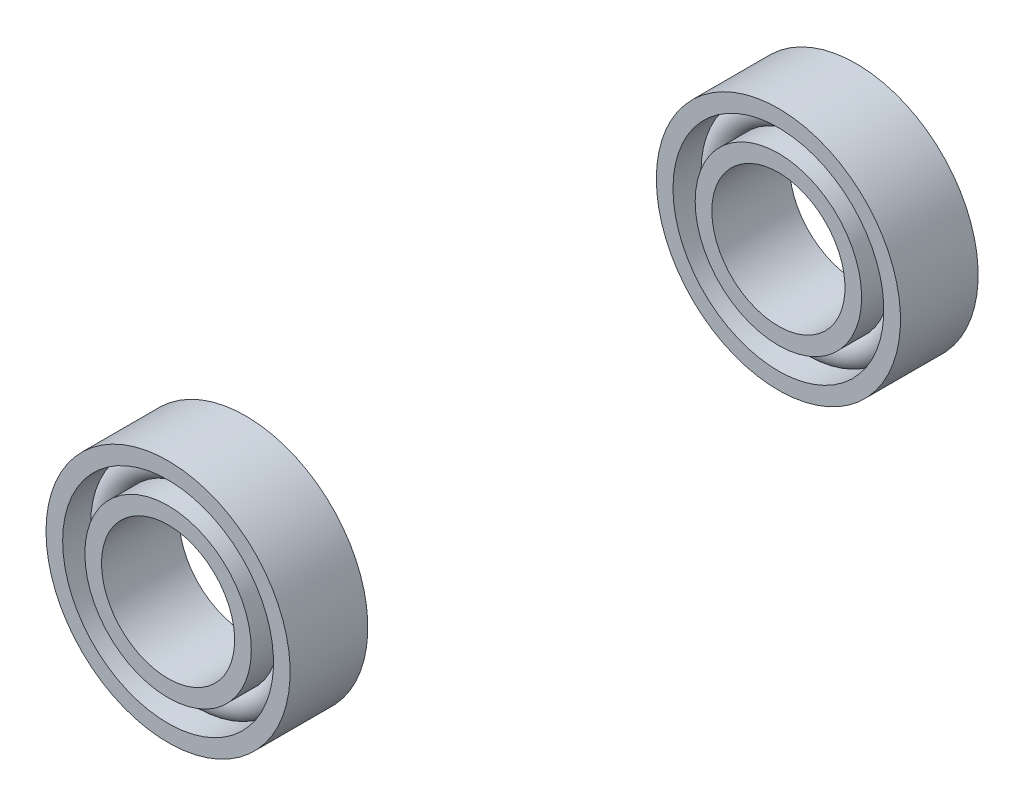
ISO-10303-21;
HEADER;
FILE_DESCRIPTION(('STEP AP214'),'2;1');
FILE_NAME('part.step','',(''),(''),'','','');
FILE_SCHEMA(('AUTOMOTIVE_DESIGN { 1 0 10303 214 1 1 1 1 }'));
ENDSEC;
DATA;
#1=APPLICATION_CONTEXT('core data for automotive mechanical design processes');
#2=APPLICATION_PROTOCOL_DEFINITION('international standard','automotive_design',2000,#1);
#3=PRODUCT_CONTEXT('',#1,'mechanical');
#4=PRODUCT('Part','Part','',(#3));
#5=PRODUCT_RELATED_PRODUCT_CATEGORY('part','',(#4));
#6=PRODUCT_DEFINITION_FORMATION('','',#4);
#7=PRODUCT_DEFINITION_CONTEXT('part definition',#1,'design');
#8=PRODUCT_DEFINITION('design','',#6,#7);
#9=PRODUCT_DEFINITION_SHAPE('','',#8);
#10=(LENGTH_UNIT() NAMED_UNIT(*) SI_UNIT(.MILLI.,.METRE.));
#11=(NAMED_UNIT(*) PLANE_ANGLE_UNIT() SI_UNIT($,.RADIAN.));
#12=(NAMED_UNIT(*) SI_UNIT($,.STERADIAN.) SOLID_ANGLE_UNIT());
#13=UNCERTAINTY_MEASURE_WITH_UNIT(LENGTH_MEASURE(1.E-05),#10,'distance_accuracy_value','');
#14=(GEOMETRIC_REPRESENTATION_CONTEXT(3) GLOBAL_UNCERTAINTY_ASSIGNED_CONTEXT((#13)) GLOBAL_UNIT_ASSIGNED_CONTEXT((#10,
#11,#12)) REPRESENTATION_CONTEXT('',''));
#15=CARTESIAN_POINT('',(0.,0.,0.));
#16=DIRECTION('',(0.,0.,1.));
#17=DIRECTION('',(1.,0.,0.));
#18=AXIS2_PLACEMENT_3D('',#15,#16,#17);
#19=CARTESIAN_POINT('',(172.5,0.,143.));
#20=DIRECTION('',(0.,0.,-1.));
#21=DIRECTION('',(-1.,0.,0.));
#22=AXIS2_PLACEMENT_3D('',#19,#20,#21);
#23=TOROIDAL_SURFACE('',#22,8.50000000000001,1.40000000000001);
#24=CARTESIAN_POINT('',(172.5,0.,142.020204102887));
#25=DIRECTION('',(0.,0.,1.));
#26=DIRECTION('',(1.,0.,0.));
#27=AXIS2_PLACEMENT_3D('',#24,#25,#26);
#28=CIRCLE('',#27,7.50000000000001);
#29=CARTESIAN_POINT('',(180.,0.,142.020204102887));
#30=VERTEX_POINT('',#29);
#31=EDGE_CURVE('E53',#30,#30,#28,.T.);
#32=ORIENTED_EDGE('',*,*,#31,.T.);
#33=EDGE_LOOP('',(#32));
#34=FACE_BOUND('',#33,.T.);
#35=CARTESIAN_POINT('',(172.5,0.,142.020204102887));
#36=DIRECTION('',(0.,0.,1.));
#37=DIRECTION('',(1.,0.,0.));
#38=AXIS2_PLACEMENT_3D('',#35,#36,#37);
#39=CIRCLE('',#38,9.50000000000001);
#40=CARTESIAN_POINT('',(182.,0.,142.020204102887));
#41=VERTEX_POINT('',#40);
#42=EDGE_CURVE('E11',#41,#41,#39,.T.);
#43=ORIENTED_EDGE('',*,*,#42,.F.);
#44=EDGE_LOOP('',(#43));
#45=FACE_BOUND('',#44,.T.);
#46=ADVANCED_FACE('F42',(#34,#45),#23,.T.);
#47=CARTESIAN_POINT('',(172.5,0.,143.979795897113));
#48=DIRECTION('',(0.,0.,-1.));
#49=DIRECTION('',(-1.,0.,0.));
#50=AXIS2_PLACEMENT_3D('',#47,#48,#49);
#51=CIRCLE('',#50,7.50000000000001);
#52=CARTESIAN_POINT('',(165.,0.,143.979795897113));
#53=VERTEX_POINT('',#52);
#54=EDGE_CURVE('E57',#53,#53,#51,.T.);
#55=ORIENTED_EDGE('',*,*,#54,.T.);
#56=EDGE_LOOP('',(#55));
#57=FACE_BOUND('',#56,.T.);
#58=CARTESIAN_POINT('',(172.5,0.,143.979795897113));
#59=DIRECTION('',(0.,0.,-1.));
#60=DIRECTION('',(-1.,0.,0.));
#61=AXIS2_PLACEMENT_3D('',#58,#59,#60);
#62=CIRCLE('',#61,9.50000000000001);
#63=CARTESIAN_POINT('',(163.,0.,143.979795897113));
#64=VERTEX_POINT('',#63);
#65=EDGE_CURVE('E49',#64,#64,#62,.T.);
#66=ORIENTED_EDGE('',*,*,#65,.F.);
#67=EDGE_LOOP('',(#66));
#68=FACE_BOUND('',#67,.T.);
#69=ADVANCED_FACE('F105',(#57,#68),#23,.T.);
#70=CARTESIAN_POINT('',(172.5,0.,134.5));
#71=DIRECTION('',(0.,0.,-1.));
#72=DIRECTION('',(-1.,0.,0.));
#73=AXIS2_PLACEMENT_3D('',#70,#71,#72);
#74=CYLINDRICAL_SURFACE('',#73,7.50000000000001);
#75=CARTESIAN_POINT('',(172.5,0.,139.5));
#76=DIRECTION('',(0.,0.,-1.));
#77=DIRECTION('',(-1.,0.,0.));
#78=AXIS2_PLACEMENT_3D('',#75,#76,#77);
#79=CIRCLE('',#78,7.50000000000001);
#80=CARTESIAN_POINT('',(165.,0.,139.5));
#81=VERTEX_POINT('',#80);
#82=EDGE_CURVE('E65',#81,#81,#79,.T.);
#83=ORIENTED_EDGE('',*,*,#82,.F.);
#84=EDGE_LOOP('',(#83));
#85=FACE_BOUND('',#84,.T.);
#86=ORIENTED_EDGE('',*,*,#31,.F.);
#87=EDGE_LOOP('',(#86));
#88=FACE_BOUND('',#87,.T.);
#89=ADVANCED_FACE('F110',(#85,#88),#74,.T.);
#90=CARTESIAN_POINT('',(172.5,0.,146.5));
#91=DIRECTION('',(0.,0.,-1.));
#92=DIRECTION('',(-1.,0.,0.));
#93=AXIS2_PLACEMENT_3D('',#90,#91,#92);
#94=CIRCLE('',#93,7.50000000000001);
#95=CARTESIAN_POINT('',(165.,0.,146.5));
#96=VERTEX_POINT('',#95);
#97=EDGE_CURVE('E68',#96,#96,#94,.T.);
#98=ORIENTED_EDGE('',*,*,#97,.T.);
#99=EDGE_LOOP('',(#98));
#100=FACE_BOUND('',#99,.T.);
#101=ORIENTED_EDGE('',*,*,#54,.F.);
#102=EDGE_LOOP('',(#101));
#103=FACE_BOUND('',#102,.T.);
#104=ADVANCED_FACE('F119',(#100,#103),#74,.T.);
#105=CARTESIAN_POINT('',(172.5,0.,134.5));
#106=DIRECTION('',(0.,0.,-1.));
#107=DIRECTION('',(-1.,0.,0.));
#108=AXIS2_PLACEMENT_3D('',#105,#106,#107);
#109=CYLINDRICAL_SURFACE('',#108,6.00000000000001);
#110=CARTESIAN_POINT('',(172.5,0.,146.5));
#111=DIRECTION('',(0.,0.,-1.));
#112=DIRECTION('',(-1.,0.,0.));
#113=AXIS2_PLACEMENT_3D('',#110,#111,#112);
#114=CIRCLE('',#113,6.00000000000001);
#115=CARTESIAN_POINT('',(166.5,0.,146.5));
#116=VERTEX_POINT('',#115);
#117=EDGE_CURVE('E71',#116,#116,#114,.T.);
#118=ORIENTED_EDGE('',*,*,#117,.F.);
#119=EDGE_LOOP('',(#118));
#120=FACE_BOUND('',#119,.T.);
#121=CARTESIAN_POINT('',(172.5,0.,139.5));
#122=DIRECTION('',(0.,0.,-1.));
#123=DIRECTION('',(-1.,0.,0.));
#124=AXIS2_PLACEMENT_3D('',#121,#122,#123);
#125=CIRCLE('',#124,6.00000000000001);
#126=CARTESIAN_POINT('',(166.5,0.,139.5));
#127=VERTEX_POINT('',#126);
#128=EDGE_CURVE('E62',#127,#127,#125,.T.);
#129=ORIENTED_EDGE('',*,*,#128,.T.);
#130=EDGE_LOOP('',(#129));
#131=FACE_BOUND('',#130,.T.);
#132=ADVANCED_FACE('F44',(#120,#131),#109,.F.);
#133=CARTESIAN_POINT('',(178.5,0.,139.5));
#134=DIRECTION('',(0.,0.,1.));
#135=DIRECTION('',(1.,0.,0.));
#136=AXIS2_PLACEMENT_3D('',#133,#134,#135);
#137=PLANE('',#136);
#138=ORIENTED_EDGE('',*,*,#128,.F.);
#139=EDGE_LOOP('',(#138));
#140=FACE_BOUND('',#139,.T.);
#141=ORIENTED_EDGE('',*,*,#82,.T.);
#142=EDGE_LOOP('',(#141));
#143=FACE_BOUND('',#142,.T.);
#144=ADVANCED_FACE('F116',(#140,#143),#137,.F.);
#145=CARTESIAN_POINT('',(180.,0.,146.5));
#146=DIRECTION('',(0.,0.,-1.));
#147=DIRECTION('',(-1.,0.,0.));
#148=AXIS2_PLACEMENT_3D('',#145,#146,#147);
#149=PLANE('',#148);
#150=ORIENTED_EDGE('',*,*,#97,.F.);
#151=EDGE_LOOP('',(#150));
#152=FACE_BOUND('',#151,.T.);
#153=ORIENTED_EDGE('',*,*,#117,.T.);
#154=EDGE_LOOP('',(#153));
#155=FACE_BOUND('',#154,.T.);
#156=ADVANCED_FACE('F101',(#152,#155),#149,.F.);
#157=CARTESIAN_POINT('',(172.5,0.,134.5));
#158=DIRECTION('',(0.,0.,-1.));
#159=DIRECTION('',(-1.,0.,0.));
#160=AXIS2_PLACEMENT_3D('',#157,#158,#159);
#161=CYLINDRICAL_SURFACE('',#160,9.50000000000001);
#162=CARTESIAN_POINT('',(172.5,0.,139.5));
#163=DIRECTION('',(0.,0.,-1.));
#164=DIRECTION('',(-1.,0.,0.));
#165=AXIS2_PLACEMENT_3D('',#162,#163,#164);
#166=CIRCLE('',#165,9.50000000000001);
#167=CARTESIAN_POINT('',(163.,0.,139.5));
#168=VERTEX_POINT('',#167);
#169=EDGE_CURVE('E74',#168,#168,#166,.T.);
#170=ORIENTED_EDGE('',*,*,#169,.T.);
#171=EDGE_LOOP('',(#170));
#172=FACE_BOUND('',#171,.T.);
#173=ORIENTED_EDGE('',*,*,#42,.T.);
#174=EDGE_LOOP('',(#173));
#175=FACE_BOUND('',#174,.T.);
#176=ADVANCED_FACE('F92',(#172,#175),#161,.F.);
#177=CARTESIAN_POINT('',(172.5,0.,146.5));
#178=DIRECTION('',(0.,0.,-1.));
#179=DIRECTION('',(-1.,0.,0.));
#180=AXIS2_PLACEMENT_3D('',#177,#178,#179);
#181=CIRCLE('',#180,9.50000000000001);
#182=CARTESIAN_POINT('',(163.,0.,146.5));
#183=VERTEX_POINT('',#182);
#184=EDGE_CURVE('E83',#183,#183,#181,.T.);
#185=ORIENTED_EDGE('',*,*,#184,.F.);
#186=EDGE_LOOP('',(#185));
#187=FACE_BOUND('',#186,.T.);
#188=ORIENTED_EDGE('',*,*,#65,.T.);
#189=EDGE_LOOP('',(#188));
#190=FACE_BOUND('',#189,.T.);
#191=ADVANCED_FACE('F89',(#187,#190),#161,.F.);
#192=CARTESIAN_POINT('',(182.,0.,139.5));
#193=DIRECTION('',(0.,0.,1.));
#194=DIRECTION('',(1.,0.,0.));
#195=AXIS2_PLACEMENT_3D('',#192,#193,#194);
#196=PLANE('',#195);
#197=ORIENTED_EDGE('',*,*,#169,.F.);
#198=EDGE_LOOP('',(#197));
#199=FACE_BOUND('',#198,.T.);
#200=CARTESIAN_POINT('',(172.5,0.,139.5));
#201=DIRECTION('',(0.,0.,-1.));
#202=DIRECTION('',(-1.,0.,0.));
#203=AXIS2_PLACEMENT_3D('',#200,#201,#202);
#204=CIRCLE('',#203,11.);
#205=CARTESIAN_POINT('',(161.5,0.,139.5));
#206=VERTEX_POINT('',#205);
#207=EDGE_CURVE('E77',#206,#206,#204,.T.);
#208=ORIENTED_EDGE('',*,*,#207,.T.);
#209=EDGE_LOOP('',(#208));
#210=FACE_BOUND('',#209,.T.);
#211=ADVANCED_FACE('F91',(#199,#210),#196,.F.);
#212=CARTESIAN_POINT('',(172.5,0.,134.5));
#213=DIRECTION('',(0.,0.,-1.));
#214=DIRECTION('',(-1.,0.,0.));
#215=AXIS2_PLACEMENT_3D('',#212,#213,#214);
#216=CYLINDRICAL_SURFACE('',#215,11.);
#217=ORIENTED_EDGE('',*,*,#207,.F.);
#218=EDGE_LOOP('',(#217));
#219=FACE_BOUND('',#218,.T.);
#220=CARTESIAN_POINT('',(172.5,0.,146.5));
#221=DIRECTION('',(0.,0.,-1.));
#222=DIRECTION('',(-1.,0.,0.));
#223=AXIS2_PLACEMENT_3D('',#220,#221,#222);
#224=CIRCLE('',#223,11.);
#225=CARTESIAN_POINT('',(161.5,0.,146.5));
#226=VERTEX_POINT('',#225);
#227=EDGE_CURVE('E80',#226,#226,#224,.T.);
#228=ORIENTED_EDGE('',*,*,#227,.T.);
#229=EDGE_LOOP('',(#228));
#230=FACE_BOUND('',#229,.T.);
#231=ADVANCED_FACE('F98',(#219,#230),#216,.T.);
#232=CARTESIAN_POINT('',(183.5,0.,146.5));
#233=DIRECTION('',(0.,0.,-1.));
#234=DIRECTION('',(-1.,0.,0.));
#235=AXIS2_PLACEMENT_3D('',#232,#233,#234);
#236=PLANE('',#235);
#237=ORIENTED_EDGE('',*,*,#227,.F.);
#238=EDGE_LOOP('',(#237));
#239=FACE_BOUND('',#238,.T.);
#240=ORIENTED_EDGE('',*,*,#184,.T.);
#241=EDGE_LOOP('',(#240));
#242=FACE_BOUND('',#241,.T.);
#243=ADVANCED_FACE('F87',(#239,#242),#236,.F.);
#244=CLOSED_SHELL('',(#46,#69,#89,#104,#132,#144,#156,#176,#191,#211,#231,#243));
#245=MANIFOLD_SOLID_BREP('B2',#244);
#246=CARTESIAN_POINT('',(172.5,0.,88.));
#247=DIRECTION('',(0.,0.,-1.));
#248=DIRECTION('',(-1.,0.,0.));
#249=AXIS2_PLACEMENT_3D('',#246,#247,#248);
#250=TOROIDAL_SURFACE('',#249,8.50000000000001,1.40000000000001);
#251=CARTESIAN_POINT('',(172.5,0.,87.0202041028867));
#252=DIRECTION('',(0.,0.,1.));
#253=DIRECTION('',(1.,0.,0.));
#254=AXIS2_PLACEMENT_3D('',#251,#252,#253);
#255=CIRCLE('',#254,7.50000000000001);
#256=CARTESIAN_POINT('',(180.,0.,87.0202041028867));
#257=VERTEX_POINT('',#256);
#258=EDGE_CURVE('E231',#257,#257,#255,.T.);
#259=ORIENTED_EDGE('',*,*,#258,.T.);
#260=EDGE_LOOP('',(#259));
#261=FACE_BOUND('',#260,.T.);
#262=CARTESIAN_POINT('',(172.5,0.,87.0202041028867));
#263=DIRECTION('',(0.,0.,1.));
#264=DIRECTION('',(1.,0.,0.));
#265=AXIS2_PLACEMENT_3D('',#262,#263,#264);
#266=CIRCLE('',#265,9.50000000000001);
#267=CARTESIAN_POINT('',(182.,0.,87.0202041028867));
#268=VERTEX_POINT('',#267);
#269=EDGE_CURVE('E41',#268,#268,#266,.T.);
#270=ORIENTED_EDGE('',*,*,#269,.F.);
#271=EDGE_LOOP('',(#270));
#272=FACE_BOUND('',#271,.T.);
#273=ADVANCED_FACE('F220',(#261,#272),#250,.T.);
#274=CARTESIAN_POINT('',(172.5,0.,88.9797958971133));
#275=DIRECTION('',(0.,0.,-1.));
#276=DIRECTION('',(-1.,0.,0.));
#277=AXIS2_PLACEMENT_3D('',#274,#275,#276);
#278=CIRCLE('',#277,7.50000000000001);
#279=CARTESIAN_POINT('',(165.,0.,88.9797958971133));
#280=VERTEX_POINT('',#279);
#281=EDGE_CURVE('E235',#280,#280,#278,.T.);
#282=ORIENTED_EDGE('',*,*,#281,.T.);
#283=EDGE_LOOP('',(#282));
#284=FACE_BOUND('',#283,.T.);
#285=CARTESIAN_POINT('',(172.5,0.,88.9797958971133));
#286=DIRECTION('',(0.,0.,-1.));
#287=DIRECTION('',(-1.,0.,0.));
#288=AXIS2_PLACEMENT_3D('',#285,#286,#287);
#289=CIRCLE('',#288,9.50000000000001);
#290=CARTESIAN_POINT('',(163.,0.,88.9797958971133));
#291=VERTEX_POINT('',#290);
#292=EDGE_CURVE('E227',#291,#291,#289,.T.);
#293=ORIENTED_EDGE('',*,*,#292,.F.);
#294=EDGE_LOOP('',(#293));
#295=FACE_BOUND('',#294,.T.);
#296=ADVANCED_FACE('F283',(#284,#295),#250,.T.);
#297=CARTESIAN_POINT('',(172.5,0.,79.5));
#298=DIRECTION('',(0.,0.,-1.));
#299=DIRECTION('',(-1.,0.,0.));
#300=AXIS2_PLACEMENT_3D('',#297,#298,#299);
#301=CYLINDRICAL_SURFACE('',#300,7.50000000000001);
#302=CARTESIAN_POINT('',(172.5,0.,84.5));
#303=DIRECTION('',(0.,0.,-1.));
#304=DIRECTION('',(-1.,0.,0.));
#305=AXIS2_PLACEMENT_3D('',#302,#303,#304);
#306=CIRCLE('',#305,7.50000000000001);
#307=CARTESIAN_POINT('',(165.,0.,84.5));
#308=VERTEX_POINT('',#307);
#309=EDGE_CURVE('E243',#308,#308,#306,.T.);
#310=ORIENTED_EDGE('',*,*,#309,.F.);
#311=EDGE_LOOP('',(#310));
#312=FACE_BOUND('',#311,.T.);
#313=ORIENTED_EDGE('',*,*,#258,.F.);
#314=EDGE_LOOP('',(#313));
#315=FACE_BOUND('',#314,.T.);
#316=ADVANCED_FACE('F288',(#312,#315),#301,.T.);
#317=CARTESIAN_POINT('',(172.5,0.,91.5));
#318=DIRECTION('',(0.,0.,-1.));
#319=DIRECTION('',(-1.,0.,0.));
#320=AXIS2_PLACEMENT_3D('',#317,#318,#319);
#321=CIRCLE('',#320,7.50000000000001);
#322=CARTESIAN_POINT('',(165.,0.,91.5));
#323=VERTEX_POINT('',#322);
#324=EDGE_CURVE('E246',#323,#323,#321,.T.);
#325=ORIENTED_EDGE('',*,*,#324,.T.);
#326=EDGE_LOOP('',(#325));
#327=FACE_BOUND('',#326,.T.);
#328=ORIENTED_EDGE('',*,*,#281,.F.);
#329=EDGE_LOOP('',(#328));
#330=FACE_BOUND('',#329,.T.);
#331=ADVANCED_FACE('F297',(#327,#330),#301,.T.);
#332=CARTESIAN_POINT('',(172.5,0.,79.5));
#333=DIRECTION('',(0.,0.,-1.));
#334=DIRECTION('',(-1.,0.,0.));
#335=AXIS2_PLACEMENT_3D('',#332,#333,#334);
#336=CYLINDRICAL_SURFACE('',#335,6.00000000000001);
#337=CARTESIAN_POINT('',(172.5,0.,91.5));
#338=DIRECTION('',(0.,0.,-1.));
#339=DIRECTION('',(-1.,0.,0.));
#340=AXIS2_PLACEMENT_3D('',#337,#338,#339);
#341=CIRCLE('',#340,6.00000000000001);
#342=CARTESIAN_POINT('',(166.5,0.,91.5));
#343=VERTEX_POINT('',#342);
#344=EDGE_CURVE('E249',#343,#343,#341,.T.);
#345=ORIENTED_EDGE('',*,*,#344,.F.);
#346=EDGE_LOOP('',(#345));
#347=FACE_BOUND('',#346,.T.);
#348=CARTESIAN_POINT('',(172.5,0.,84.5));
#349=DIRECTION('',(0.,0.,-1.));
#350=DIRECTION('',(-1.,0.,0.));
#351=AXIS2_PLACEMENT_3D('',#348,#349,#350);
#352=CIRCLE('',#351,6.00000000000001);
#353=CARTESIAN_POINT('',(166.5,0.,84.5));
#354=VERTEX_POINT('',#353);
#355=EDGE_CURVE('E240',#354,#354,#352,.T.);
#356=ORIENTED_EDGE('',*,*,#355,.T.);
#357=EDGE_LOOP('',(#356));
#358=FACE_BOUND('',#357,.T.);
#359=ADVANCED_FACE('F222',(#347,#358),#336,.F.);
#360=CARTESIAN_POINT('',(178.5,0.,84.5));
#361=DIRECTION('',(0.,0.,1.));
#362=DIRECTION('',(1.,0.,0.));
#363=AXIS2_PLACEMENT_3D('',#360,#361,#362);
#364=PLANE('',#363);
#365=ORIENTED_EDGE('',*,*,#355,.F.);
#366=EDGE_LOOP('',(#365));
#367=FACE_BOUND('',#366,.T.);
#368=ORIENTED_EDGE('',*,*,#309,.T.);
#369=EDGE_LOOP('',(#368));
#370=FACE_BOUND('',#369,.T.);
#371=ADVANCED_FACE('F294',(#367,#370),#364,.F.);
#372=CARTESIAN_POINT('',(180.,0.,91.5));
#373=DIRECTION('',(0.,0.,-1.));
#374=DIRECTION('',(-1.,0.,0.));
#375=AXIS2_PLACEMENT_3D('',#372,#373,#374);
#376=PLANE('',#375);
#377=ORIENTED_EDGE('',*,*,#324,.F.);
#378=EDGE_LOOP('',(#377));
#379=FACE_BOUND('',#378,.T.);
#380=ORIENTED_EDGE('',*,*,#344,.T.);
#381=EDGE_LOOP('',(#380));
#382=FACE_BOUND('',#381,.T.);
#383=ADVANCED_FACE('F279',(#379,#382),#376,.F.);
#384=CARTESIAN_POINT('',(172.5,0.,79.5));
#385=DIRECTION('',(0.,0.,-1.));
#386=DIRECTION('',(-1.,0.,0.));
#387=AXIS2_PLACEMENT_3D('',#384,#385,#386);
#388=CYLINDRICAL_SURFACE('',#387,9.50000000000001);
#389=CARTESIAN_POINT('',(172.5,0.,84.5));
#390=DIRECTION('',(0.,0.,-1.));
#391=DIRECTION('',(-1.,0.,0.));
#392=AXIS2_PLACEMENT_3D('',#389,#390,#391);
#393=CIRCLE('',#392,9.50000000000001);
#394=CARTESIAN_POINT('',(163.,0.,84.5));
#395=VERTEX_POINT('',#394);
#396=EDGE_CURVE('E252',#395,#395,#393,.T.);
#397=ORIENTED_EDGE('',*,*,#396,.T.);
#398=EDGE_LOOP('',(#397));
#399=FACE_BOUND('',#398,.T.);
#400=ORIENTED_EDGE('',*,*,#269,.T.);
#401=EDGE_LOOP('',(#400));
#402=FACE_BOUND('',#401,.T.);
#403=ADVANCED_FACE('F270',(#399,#402),#388,.F.);
#404=CARTESIAN_POINT('',(172.5,0.,91.5));
#405=DIRECTION('',(0.,0.,-1.));
#406=DIRECTION('',(-1.,0.,0.));
#407=AXIS2_PLACEMENT_3D('',#404,#405,#406);
#408=CIRCLE('',#407,9.50000000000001);
#409=CARTESIAN_POINT('',(163.,0.,91.5));
#410=VERTEX_POINT('',#409);
#411=EDGE_CURVE('E261',#410,#410,#408,.T.);
#412=ORIENTED_EDGE('',*,*,#411,.F.);
#413=EDGE_LOOP('',(#412));
#414=FACE_BOUND('',#413,.T.);
#415=ORIENTED_EDGE('',*,*,#292,.T.);
#416=EDGE_LOOP('',(#415));
#417=FACE_BOUND('',#416,.T.);
#418=ADVANCED_FACE('F267',(#414,#417),#388,.F.);
#419=CARTESIAN_POINT('',(182.,0.,84.5));
#420=DIRECTION('',(0.,0.,1.));
#421=DIRECTION('',(1.,0.,0.));
#422=AXIS2_PLACEMENT_3D('',#419,#420,#421);
#423=PLANE('',#422);
#424=ORIENTED_EDGE('',*,*,#396,.F.);
#425=EDGE_LOOP('',(#424));
#426=FACE_BOUND('',#425,.T.);
#427=CARTESIAN_POINT('',(172.5,0.,84.5));
#428=DIRECTION('',(0.,0.,-1.));
#429=DIRECTION('',(-1.,0.,0.));
#430=AXIS2_PLACEMENT_3D('',#427,#428,#429);
#431=CIRCLE('',#430,11.);
#432=CARTESIAN_POINT('',(161.5,0.,84.5));
#433=VERTEX_POINT('',#432);
#434=EDGE_CURVE('E255',#433,#433,#431,.T.);
#435=ORIENTED_EDGE('',*,*,#434,.T.);
#436=EDGE_LOOP('',(#435));
#437=FACE_BOUND('',#436,.T.);
#438=ADVANCED_FACE('F269',(#426,#437),#423,.F.);
#439=CARTESIAN_POINT('',(172.5,0.,79.5));
#440=DIRECTION('',(0.,0.,-1.));
#441=DIRECTION('',(-1.,0.,0.));
#442=AXIS2_PLACEMENT_3D('',#439,#440,#441);
#443=CYLINDRICAL_SURFACE('',#442,11.);
#444=ORIENTED_EDGE('',*,*,#434,.F.);
#445=EDGE_LOOP('',(#444));
#446=FACE_BOUND('',#445,.T.);
#447=CARTESIAN_POINT('',(172.5,0.,91.5));
#448=DIRECTION('',(0.,0.,-1.));
#449=DIRECTION('',(-1.,0.,0.));
#450=AXIS2_PLACEMENT_3D('',#447,#448,#449);
#451=CIRCLE('',#450,11.);
#452=CARTESIAN_POINT('',(161.5,0.,91.5));
#453=VERTEX_POINT('',#452);
#454=EDGE_CURVE('E258',#453,#453,#451,.T.);
#455=ORIENTED_EDGE('',*,*,#454,.T.);
#456=EDGE_LOOP('',(#455));
#457=FACE_BOUND('',#456,.T.);
#458=ADVANCED_FACE('F276',(#446,#457),#443,.T.);
#459=CARTESIAN_POINT('',(183.5,0.,91.5));
#460=DIRECTION('',(0.,0.,-1.));
#461=DIRECTION('',(-1.,0.,0.));
#462=AXIS2_PLACEMENT_3D('',#459,#460,#461);
#463=PLANE('',#462);
#464=ORIENTED_EDGE('',*,*,#454,.F.);
#465=EDGE_LOOP('',(#464));
#466=FACE_BOUND('',#465,.T.);
#467=ORIENTED_EDGE('',*,*,#411,.T.);
#468=EDGE_LOOP('',(#467));
#469=FACE_BOUND('',#468,.T.);
#470=ADVANCED_FACE('F265',(#466,#469),#463,.F.);
#471=CLOSED_SHELL('',(#273,#296,#316,#331,#359,#371,#383,#403,#418,#438,#458,#470));
#472=MANIFOLD_SOLID_BREP('B6',#471);
#473=ADVANCED_BREP_SHAPE_REPRESENTATION('',(#18,#245,#472),#14);
#474=SHAPE_DEFINITION_REPRESENTATION(#9,#473);
ENDSEC;
END-ISO-10303-21;
